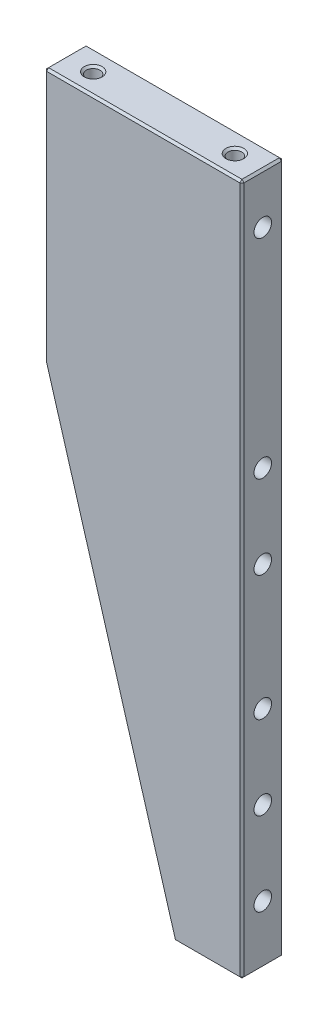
ISO-10303-21;
HEADER;
FILE_DESCRIPTION(('STEP AP214'),'2;1');
FILE_NAME('part.step','',(''),(''),'','','');
FILE_SCHEMA(('AUTOMOTIVE_DESIGN { 1 0 10303 214 1 1 1 1 }'));
ENDSEC;
DATA;
#1=APPLICATION_CONTEXT('core data for automotive mechanical design processes');
#2=APPLICATION_PROTOCOL_DEFINITION('international standard','automotive_design',2000,#1);
#3=PRODUCT_CONTEXT('',#1,'mechanical');
#4=PRODUCT('Part','Part','',(#3));
#5=PRODUCT_RELATED_PRODUCT_CATEGORY('part','',(#4));
#6=PRODUCT_DEFINITION_FORMATION('','',#4);
#7=PRODUCT_DEFINITION_CONTEXT('part definition',#1,'design');
#8=PRODUCT_DEFINITION('design','',#6,#7);
#9=PRODUCT_DEFINITION_SHAPE('','',#8);
#10=(LENGTH_UNIT() NAMED_UNIT(*) SI_UNIT(.MILLI.,.METRE.));
#11=(NAMED_UNIT(*) PLANE_ANGLE_UNIT() SI_UNIT($,.RADIAN.));
#12=(NAMED_UNIT(*) SI_UNIT($,.STERADIAN.) SOLID_ANGLE_UNIT());
#13=UNCERTAINTY_MEASURE_WITH_UNIT(LENGTH_MEASURE(1.E-05),#10,'distance_accuracy_value','');
#14=(GEOMETRIC_REPRESENTATION_CONTEXT(3) GLOBAL_UNCERTAINTY_ASSIGNED_CONTEXT((#13)) GLOBAL_UNIT_ASSIGNED_CONTEXT((#10,
#11,#12)) REPRESENTATION_CONTEXT('',''));
#15=CARTESIAN_POINT('',(0.,0.,0.));
#16=DIRECTION('',(0.,0.,1.));
#17=DIRECTION('',(1.,0.,0.));
#18=AXIS2_PLACEMENT_3D('',#15,#16,#17);
#19=CARTESIAN_POINT('',(45.4104599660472,-188.835616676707,10.));
#20=DIRECTION('',(0.958954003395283,0.283561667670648,0.));
#21=DIRECTION('',(-0.283561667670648,0.958954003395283,0.));
#22=AXIS2_PLACEMENT_3D('',#19,#20,#21);
#23=PLANE('',#22);
#24=DIRECTION('',(0.,0.,1.));
#25=VECTOR('',#24,1.);
#26=CARTESIAN_POINT('',(38.4480690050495,-165.290076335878,10.));
#27=LINE('',#26,#25);
#28=CARTESIAN_POINT('',(38.4480690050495,-165.290076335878,0.5));
#29=VERTEX_POINT('',#28);
#30=CARTESIAN_POINT('',(38.4480690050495,-165.290076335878,9.5));
#31=VERTEX_POINT('',#30);
#32=EDGE_CURVE('E270',#29,#31,#27,.T.);
#33=ORIENTED_EDGE('',*,*,#32,.T.);
#34=DIRECTION('',(-0.283561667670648,0.958954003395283,0.));
#35=VECTOR('',#34,1.);
#36=CARTESIAN_POINT('',(45.4104599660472,-188.835616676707,9.5));
#37=LINE('',#36,#35);
#38=CARTESIAN_POINT('',(7.59274229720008,-60.9429714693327,9.5));
#39=VERTEX_POINT('',#38);
#40=EDGE_CURVE('E273',#31,#39,#37,.T.);
#41=ORIENTED_EDGE('',*,*,#40,.T.);
#42=DIRECTION('',(0.,0.,-1.));
#43=VECTOR('',#42,1.);
#44=CARTESIAN_POINT('',(7.59274229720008,-60.9429714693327,10.));
#45=LINE('',#44,#43);
#46=CARTESIAN_POINT('',(7.59274229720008,-60.9429714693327,0.5));
#47=VERTEX_POINT('',#46);
#48=EDGE_CURVE('E202',#39,#47,#45,.T.);
#49=ORIENTED_EDGE('',*,*,#48,.T.);
#50=DIRECTION('',(0.283561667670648,-0.958954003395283,0.));
#51=VECTOR('',#50,1.);
#52=CARTESIAN_POINT('',(38.6579926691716,-166.,0.5));
#53=LINE('',#52,#51);
#54=EDGE_CURVE('E268',#47,#29,#53,.T.);
#55=ORIENTED_EDGE('',*,*,#54,.T.);
#56=EDGE_LOOP('',(#33,#41,#49,#55));
#57=FACE_BOUND('',#56,.T.);
#58=ADVANCED_FACE('F16',(#57),#23,.F.);
#59=CARTESIAN_POINT('',(55.,0.,10.));
#60=DIRECTION('',(-1.,0.,0.));
#61=DIRECTION('',(0.,-1.,0.));
#62=AXIS2_PLACEMENT_3D('',#59,#60,#61);
#63=PLANE('',#62);
#64=DIRECTION('',(0.,0.,1.));
#65=VECTOR('',#64,1.);
#66=CARTESIAN_POINT('',(55.,-0.5,10.));
#67=LINE('',#66,#65);
#68=CARTESIAN_POINT('',(55.,-0.5,0.5));
#69=VERTEX_POINT('',#68);
#70=CARTESIAN_POINT('',(55.,-0.5,9.5));
#71=VERTEX_POINT('',#70);
#72=EDGE_CURVE('E299',#69,#71,#67,.T.);
#73=ORIENTED_EDGE('',*,*,#72,.T.);
#74=DIRECTION('',(0.,-1.,0.));
#75=VECTOR('',#74,1.);
#76=CARTESIAN_POINT('',(55.,0.,9.5));
#77=LINE('',#76,#75);
#78=CARTESIAN_POINT('',(55.,-165.5,9.5));
#79=VERTEX_POINT('',#78);
#80=EDGE_CURVE('E301',#71,#79,#77,.T.);
#81=ORIENTED_EDGE('',*,*,#80,.T.);
#82=DIRECTION('',(0.,0.,-1.));
#83=VECTOR('',#82,1.);
#84=CARTESIAN_POINT('',(55.,-165.5,10.));
#85=LINE('',#84,#83);
#86=CARTESIAN_POINT('',(55.,-165.5,0.5));
#87=VERTEX_POINT('',#86);
#88=EDGE_CURVE('E297',#79,#87,#85,.T.);
#89=ORIENTED_EDGE('',*,*,#88,.T.);
#90=DIRECTION('',(0.,1.,0.));
#91=VECTOR('',#90,1.);
#92=CARTESIAN_POINT('',(55.,0.,0.5));
#93=LINE('',#92,#91);
#94=EDGE_CURVE('E295',#87,#69,#93,.T.);
#95=ORIENTED_EDGE('',*,*,#94,.T.);
#96=EDGE_LOOP('',(#73,#81,#89,#95));
#97=FACE_BOUND('',#96,.T.);
#98=CARTESIAN_POINT('',(55.,-112.,5.));
#99=DIRECTION('',(1.,0.,0.));
#100=DIRECTION('',(0.,0.,-1.));
#101=AXIS2_PLACEMENT_3D('',#98,#99,#100);
#102=CIRCLE('',#101,2.1);
#103=CARTESIAN_POINT('',(55.,-112.,2.9));
#104=VERTEX_POINT('',#103);
#105=EDGE_CURVE('E166',#104,#104,#102,.T.);
#106=ORIENTED_EDGE('',*,*,#105,.F.);
#107=EDGE_LOOP('',(#106));
#108=FACE_BOUND('',#107,.T.);
#109=CARTESIAN_POINT('',(55.,-62.,5.));
#110=DIRECTION('',(1.,0.,0.));
#111=DIRECTION('',(0.,0.,-1.));
#112=AXIS2_PLACEMENT_3D('',#109,#110,#111);
#113=CIRCLE('',#112,2.1);
#114=CARTESIAN_POINT('',(55.,-62.,2.9));
#115=VERTEX_POINT('',#114);
#116=EDGE_CURVE('E172',#115,#115,#113,.T.);
#117=ORIENTED_EDGE('',*,*,#116,.F.);
#118=EDGE_LOOP('',(#117));
#119=FACE_BOUND('',#118,.T.);
#120=CARTESIAN_POINT('',(55.,-132.,5.0000000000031));
#121=DIRECTION('',(1.,0.,0.));
#122=DIRECTION('',(0.,0.,-1.));
#123=AXIS2_PLACEMENT_3D('',#120,#121,#122);
#124=CIRCLE('',#123,2.1);
#125=CARTESIAN_POINT('',(55.,-132.,2.9000000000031));
#126=VERTEX_POINT('',#125);
#127=EDGE_CURVE('E178',#126,#126,#124,.T.);
#128=ORIENTED_EDGE('',*,*,#127,.F.);
#129=EDGE_LOOP('',(#128));
#130=FACE_BOUND('',#129,.T.);
#131=CARTESIAN_POINT('',(55.,-12.,5.));
#132=DIRECTION('',(1.,0.,0.));
#133=DIRECTION('',(0.,0.,-1.));
#134=AXIS2_PLACEMENT_3D('',#131,#132,#133);
#135=CIRCLE('',#134,2.1);
#136=CARTESIAN_POINT('',(55.,-12.,2.9));
#137=VERTEX_POINT('',#136);
#138=EDGE_CURVE('E184',#137,#137,#135,.T.);
#139=ORIENTED_EDGE('',*,*,#138,.F.);
#140=EDGE_LOOP('',(#139));
#141=FACE_BOUND('',#140,.T.);
#142=CARTESIAN_POINT('',(55.,-82.,5.0000000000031));
#143=DIRECTION('',(1.,0.,0.));
#144=DIRECTION('',(0.,0.,-1.));
#145=AXIS2_PLACEMENT_3D('',#142,#143,#144);
#146=CIRCLE('',#145,2.1);
#147=CARTESIAN_POINT('',(55.,-82.,2.9000000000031));
#148=VERTEX_POINT('',#147);
#149=EDGE_CURVE('E190',#148,#148,#146,.T.);
#150=ORIENTED_EDGE('',*,*,#149,.F.);
#151=EDGE_LOOP('',(#150));
#152=FACE_BOUND('',#151,.T.);
#153=CARTESIAN_POINT('',(55.,-152.,5.00000000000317));
#154=DIRECTION('',(1.,0.,0.));
#155=DIRECTION('',(0.,0.,-1.));
#156=AXIS2_PLACEMENT_3D('',#153,#154,#155);
#157=CIRCLE('',#156,2.1);
#158=CARTESIAN_POINT('',(55.,-152.,2.90000000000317));
#159=VERTEX_POINT('',#158);
#160=EDGE_CURVE('E196',#159,#159,#157,.T.);
#161=ORIENTED_EDGE('',*,*,#160,.F.);
#162=EDGE_LOOP('',(#161));
#163=FACE_BOUND('',#162,.T.);
#164=ADVANCED_FACE('F444',(#97,#108,#119,#130,#141,#152,#163),#63,.F.);
#165=CARTESIAN_POINT('',(0.,0.,10.));
#166=DIRECTION('',(0.,-1.,0.));
#167=DIRECTION('',(0.,0.,-1.));
#168=AXIS2_PLACEMENT_3D('',#165,#166,#167);
#169=PLANE('',#168);
#170=CARTESIAN_POINT('',(48.2963711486,0.,5.));
#171=DIRECTION('',(0.,-1.,0.));
#172=DIRECTION('',(0.,0.,-1.));
#173=AXIS2_PLACEMENT_3D('',#170,#171,#172);
#174=CIRCLE('',#173,2.14999999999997);
#175=CARTESIAN_POINT('',(48.2963711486,0.,2.85000000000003));
#176=VERTEX_POINT('',#175);
#177=EDGE_CURVE('E262',#176,#176,#174,.T.);
#178=ORIENTED_EDGE('',*,*,#177,.T.);
#179=EDGE_LOOP('',(#178));
#180=FACE_BOUND('',#179,.T.);
#181=CARTESIAN_POINT('',(14.2963711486,0.,5.));
#182=DIRECTION('',(0.,-1.,0.));
#183=DIRECTION('',(0.,0.,-1.));
#184=AXIS2_PLACEMENT_3D('',#181,#182,#183);
#185=CIRCLE('',#184,2.15);
#186=CARTESIAN_POINT('',(14.2963711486,0.,2.85));
#187=VERTEX_POINT('',#186);
#188=EDGE_CURVE('E259',#187,#187,#185,.T.);
#189=ORIENTED_EDGE('',*,*,#188,.T.);
#190=EDGE_LOOP('',(#189));
#191=FACE_BOUND('',#190,.T.);
#192=DIRECTION('',(1.,0.,0.));
#193=VECTOR('',#192,1.);
#194=CARTESIAN_POINT('',(0.,0.,9.5));
#195=LINE('',#194,#193);
#196=CARTESIAN_POINT('',(8.09274229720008,0.,9.5));
#197=VERTEX_POINT('',#196);
#198=CARTESIAN_POINT('',(54.5,0.,9.5));
#199=VERTEX_POINT('',#198);
#200=EDGE_CURVE('E254',#197,#199,#195,.T.);
#201=ORIENTED_EDGE('',*,*,#200,.T.);
#202=DIRECTION('',(0.,0.,-1.));
#203=VECTOR('',#202,1.);
#204=CARTESIAN_POINT('',(54.5,0.,10.));
#205=LINE('',#204,#203);
#206=CARTESIAN_POINT('',(54.5,0.,0.5));
#207=VERTEX_POINT('',#206);
#208=EDGE_CURVE('E256',#199,#207,#205,.T.);
#209=ORIENTED_EDGE('',*,*,#208,.T.);
#210=DIRECTION('',(-1.,0.,0.));
#211=VECTOR('',#210,1.);
#212=CARTESIAN_POINT('',(7.59274229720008,0.,0.5));
#213=LINE('',#212,#211);
#214=CARTESIAN_POINT('',(8.09274229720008,0.,0.5));
#215=VERTEX_POINT('',#214);
#216=EDGE_CURVE('E250',#207,#215,#213,.T.);
#217=ORIENTED_EDGE('',*,*,#216,.T.);
#218=DIRECTION('',(0.,0.,1.));
#219=VECTOR('',#218,1.);
#220=CARTESIAN_POINT('',(8.09274229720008,0.,10.));
#221=LINE('',#220,#219);
#222=EDGE_CURVE('E252',#215,#197,#221,.T.);
#223=ORIENTED_EDGE('',*,*,#222,.T.);
#224=EDGE_LOOP('',(#201,#209,#217,#223));
#225=FACE_BOUND('',#224,.T.);
#226=ADVANCED_FACE('F428',(#180,#191,#225),#169,.F.);
#227=CARTESIAN_POINT('',(0.,0.,10.));
#228=DIRECTION('',(0.,0.,-1.));
#229=DIRECTION('',(-1.,0.,0.));
#230=AXIS2_PLACEMENT_3D('',#227,#228,#229);
#231=PLANE('',#230);
#232=DIRECTION('',(-1.,0.,0.));
#233=VECTOR('',#232,1.);
#234=CARTESIAN_POINT('',(0.,-0.5,10.));
#235=LINE('',#234,#233);
#236=CARTESIAN_POINT('',(54.5,-0.5,10.));
#237=VERTEX_POINT('',#236);
#238=CARTESIAN_POINT('',(8.09274229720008,-0.5,10.));
#239=VERTEX_POINT('',#238);
#240=EDGE_CURVE('E291',#237,#239,#235,.T.);
#241=ORIENTED_EDGE('',*,*,#240,.T.);
#242=DIRECTION('',(0.,-1.,0.));
#243=VECTOR('',#242,1.);
#244=CARTESIAN_POINT('',(8.09274229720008,0.,10.));
#245=LINE('',#244,#243);
#246=CARTESIAN_POINT('',(8.09274229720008,-60.8705956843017,10.));
#247=VERTEX_POINT('',#246);
#248=EDGE_CURVE('E293',#239,#247,#245,.T.);
#249=ORIENTED_EDGE('',*,*,#248,.T.);
#250=DIRECTION('',(0.283561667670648,-0.958954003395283,0.));
#251=VECTOR('',#250,1.);
#252=CARTESIAN_POINT('',(-9.1100630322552,-2.69383584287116,10.));
#253=LINE('',#252,#251);
#254=CARTESIAN_POINT('',(39.0315446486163,-165.5,10.));
#255=VERTEX_POINT('',#254);
#256=EDGE_CURVE('E286',#247,#255,#253,.T.);
#257=ORIENTED_EDGE('',*,*,#256,.T.);
#258=DIRECTION('',(1.,0.,0.));
#259=VECTOR('',#258,1.);
#260=CARTESIAN_POINT('',(0.,-165.5,10.));
#261=LINE('',#260,#259);
#262=CARTESIAN_POINT('',(54.5,-165.5,10.));
#263=VERTEX_POINT('',#262);
#264=EDGE_CURVE('E284',#255,#263,#261,.T.);
#265=ORIENTED_EDGE('',*,*,#264,.T.);
#266=DIRECTION('',(0.,1.,0.));
#267=VECTOR('',#266,1.);
#268=CARTESIAN_POINT('',(54.5,0.,10.));
#269=LINE('',#268,#267);
#270=EDGE_CURVE('E288',#263,#237,#269,.T.);
#271=ORIENTED_EDGE('',*,*,#270,.T.);
#272=EDGE_LOOP('',(#241,#249,#257,#265,#271));
#273=FACE_BOUND('',#272,.T.);
#274=ADVANCED_FACE('F907',(#273),#231,.F.);
#275=CARTESIAN_POINT('',(0.,0.,0.));
#276=DIRECTION('',(0.,0.,-1.));
#277=DIRECTION('',(-1.,0.,0.));
#278=AXIS2_PLACEMENT_3D('',#275,#276,#277);
#279=PLANE('',#278);
#280=DIRECTION('',(-1.,0.,0.));
#281=VECTOR('',#280,1.);
#282=CARTESIAN_POINT('',(38.6579926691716,-165.5,0.));
#283=LINE('',#282,#281);
#284=CARTESIAN_POINT('',(54.5,-165.5,0.));
#285=VERTEX_POINT('',#284);
#286=CARTESIAN_POINT('',(39.0315446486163,-165.5,0.));
#287=VERTEX_POINT('',#286);
#288=EDGE_CURVE('E25',#285,#287,#283,.T.);
#289=ORIENTED_EDGE('',*,*,#288,.T.);
#290=DIRECTION('',(-0.283561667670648,0.958954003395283,0.));
#291=VECTOR('',#290,1.);
#292=CARTESIAN_POINT('',(8.07221929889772,-60.8011906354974,0.));
#293=LINE('',#292,#291);
#294=CARTESIAN_POINT('',(8.09274229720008,-60.8705956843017,0.));
#295=VERTEX_POINT('',#294);
#296=EDGE_CURVE('E11',#287,#295,#293,.T.);
#297=ORIENTED_EDGE('',*,*,#296,.T.);
#298=DIRECTION('',(0.,1.,0.));
#299=VECTOR('',#298,1.);
#300=CARTESIAN_POINT('',(8.09274229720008,0.,0.));
#301=LINE('',#300,#299);
#302=CARTESIAN_POINT('',(8.09274229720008,-0.5,0.));
#303=VERTEX_POINT('',#302);
#304=EDGE_CURVE('E310',#295,#303,#301,.T.);
#305=ORIENTED_EDGE('',*,*,#304,.T.);
#306=DIRECTION('',(1.,0.,0.));
#307=VECTOR('',#306,1.);
#308=CARTESIAN_POINT('',(55.,-0.5,0.));
#309=LINE('',#308,#307);
#310=CARTESIAN_POINT('',(54.5,-0.5,0.));
#311=VERTEX_POINT('',#310);
#312=EDGE_CURVE('E312',#303,#311,#309,.T.);
#313=ORIENTED_EDGE('',*,*,#312,.T.);
#314=DIRECTION('',(0.,-1.,0.));
#315=VECTOR('',#314,1.);
#316=CARTESIAN_POINT('',(54.5,-166.,0.));
#317=LINE('',#316,#315);
#318=EDGE_CURVE('E36',#311,#285,#317,.T.);
#319=ORIENTED_EDGE('',*,*,#318,.T.);
#320=EDGE_LOOP('',(#289,#297,#305,#313,#319));
#321=FACE_BOUND('',#320,.T.);
#322=ADVANCED_FACE('F413',(#321),#279,.T.);
#323=CARTESIAN_POINT('',(108.469714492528,-166.,0.));
#324=DIRECTION('',(0.,1.,0.));
#325=DIRECTION('',(0.,0.,1.));
#326=AXIS2_PLACEMENT_3D('',#323,#324,#325);
#327=PLANE('',#326);
#328=DIRECTION('',(-1.,0.,0.));
#329=VECTOR('',#328,1.);
#330=CARTESIAN_POINT('',(108.469714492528,-166.,9.5));
#331=LINE('',#330,#329);
#332=CARTESIAN_POINT('',(54.5,-166.,9.5));
#333=VERTEX_POINT('',#332);
#334=CARTESIAN_POINT('',(39.1579926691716,-166.,9.5));
#335=VERTEX_POINT('',#334);
#336=EDGE_CURVE('E279',#333,#335,#331,.T.);
#337=ORIENTED_EDGE('',*,*,#336,.T.);
#338=DIRECTION('',(0.,0.,-1.));
#339=VECTOR('',#338,1.);
#340=CARTESIAN_POINT('',(39.1579926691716,-166.,0.));
#341=LINE('',#340,#339);
#342=CARTESIAN_POINT('',(39.1579926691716,-166.,0.5));
#343=VERTEX_POINT('',#342);
#344=EDGE_CURVE('E281',#335,#343,#341,.T.);
#345=ORIENTED_EDGE('',*,*,#344,.T.);
#346=DIRECTION('',(1.,0.,0.));
#347=VECTOR('',#346,1.);
#348=CARTESIAN_POINT('',(55.,-166.,0.5));
#349=LINE('',#348,#347);
#350=CARTESIAN_POINT('',(54.5,-166.,0.5));
#351=VERTEX_POINT('',#350);
#352=EDGE_CURVE('E275',#343,#351,#349,.T.);
#353=ORIENTED_EDGE('',*,*,#352,.T.);
#354=DIRECTION('',(0.,0.,1.));
#355=VECTOR('',#354,1.);
#356=CARTESIAN_POINT('',(54.5,-166.,0.));
#357=LINE('',#356,#355);
#358=EDGE_CURVE('E277',#351,#333,#357,.T.);
#359=ORIENTED_EDGE('',*,*,#358,.T.);
#360=EDGE_LOOP('',(#337,#345,#353,#359));
#361=FACE_BOUND('',#360,.T.);
#362=ADVANCED_FACE('F453',(#361),#327,.F.);
#363=CARTESIAN_POINT('',(7.59274229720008,0.,0.));
#364=DIRECTION('',(1.,0.,0.));
#365=DIRECTION('',(0.,0.,-1.));
#366=AXIS2_PLACEMENT_3D('',#363,#364,#365);
#367=PLANE('',#366);
#368=ORIENTED_EDGE('',*,*,#48,.F.);
#369=DIRECTION('',(0.,1.,0.));
#370=VECTOR('',#369,1.);
#371=CARTESIAN_POINT('',(7.59274229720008,0.,9.5));
#372=LINE('',#371,#370);
#373=CARTESIAN_POINT('',(7.59274229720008,-0.5,9.5));
#374=VERTEX_POINT('',#373);
#375=EDGE_CURVE('E308',#39,#374,#372,.T.);
#376=ORIENTED_EDGE('',*,*,#375,.T.);
#377=DIRECTION('',(0.,0.,-1.));
#378=VECTOR('',#377,1.);
#379=CARTESIAN_POINT('',(7.59274229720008,-0.5,0.));
#380=LINE('',#379,#378);
#381=CARTESIAN_POINT('',(7.59274229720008,-0.5,0.5));
#382=VERTEX_POINT('',#381);
#383=EDGE_CURVE('E306',#374,#382,#380,.T.);
#384=ORIENTED_EDGE('',*,*,#383,.T.);
#385=DIRECTION('',(0.,-1.,0.));
#386=VECTOR('',#385,1.);
#387=CARTESIAN_POINT('',(7.59274229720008,-60.9429714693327,0.5));
#388=LINE('',#387,#386);
#389=EDGE_CURVE('E304',#382,#47,#388,.T.);
#390=ORIENTED_EDGE('',*,*,#389,.T.);
#391=EDGE_LOOP('',(#368,#376,#384,#390));
#392=FACE_BOUND('',#391,.T.);
#393=ADVANCED_FACE('F472',(#392),#367,.F.);
#394=CARTESIAN_POINT('',(42.6,-152.,5.00000000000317));
#395=DIRECTION('',(1.,0.,0.));
#396=DIRECTION('',(0.,0.,-1.));
#397=AXIS2_PLACEMENT_3D('',#394,#395,#396);
#398=CONICAL_SURFACE('',#397,2.1,1.02974425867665);
#399=CARTESIAN_POINT('',(41.3381927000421,-152.,5.00000000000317));
#400=VERTEX_POINT('',#399);
#401=VERTEX_LOOP('',#400);
#402=FACE_BOUND('',#401,.T.);
#403=CARTESIAN_POINT('',(42.6,-152.,5.00000000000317));
#404=DIRECTION('',(1.,0.,0.));
#405=DIRECTION('',(0.,0.,-1.));
#406=AXIS2_PLACEMENT_3D('',#403,#404,#405);
#407=CIRCLE('',#406,2.1);
#408=CARTESIAN_POINT('',(42.6,-152.,2.90000000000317));
#409=VERTEX_POINT('',#408);
#410=EDGE_CURVE('E199',#409,#409,#407,.T.);
#411=ORIENTED_EDGE('',*,*,#410,.T.);
#412=EDGE_LOOP('',(#411));
#413=FACE_BOUND('',#412,.T.);
#414=ADVANCED_FACE('F872',(#402,#413),#398,.F.);
#415=CARTESIAN_POINT('',(55.,-152.,5.00000000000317));
#416=DIRECTION('',(1.,0.,0.));
#417=DIRECTION('',(0.,0.,-1.));
#418=AXIS2_PLACEMENT_3D('',#415,#416,#417);
#419=CYLINDRICAL_SURFACE('',#418,2.1);
#420=ORIENTED_EDGE('',*,*,#410,.F.);
#421=EDGE_LOOP('',(#420));
#422=FACE_BOUND('',#421,.T.);
#423=ORIENTED_EDGE('',*,*,#160,.T.);
#424=EDGE_LOOP('',(#423));
#425=FACE_BOUND('',#424,.T.);
#426=ADVANCED_FACE('F862',(#422,#425),#419,.F.);
#427=CARTESIAN_POINT('',(42.6,-82.,5.0000000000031));
#428=DIRECTION('',(1.,0.,0.));
#429=DIRECTION('',(0.,0.,-1.));
#430=AXIS2_PLACEMENT_3D('',#427,#428,#429);
#431=CONICAL_SURFACE('',#430,2.1,1.02974425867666);
#432=CARTESIAN_POINT('',(41.3381927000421,-82.,5.0000000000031));
#433=VERTEX_POINT('',#432);
#434=VERTEX_LOOP('',#433);
#435=FACE_BOUND('',#434,.T.);
#436=CARTESIAN_POINT('',(42.6,-82.,5.0000000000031));
#437=DIRECTION('',(1.,0.,0.));
#438=DIRECTION('',(0.,0.,-1.));
#439=AXIS2_PLACEMENT_3D('',#436,#437,#438);
#440=CIRCLE('',#439,2.1);
#441=CARTESIAN_POINT('',(42.6,-82.,2.9000000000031));
#442=VERTEX_POINT('',#441);
#443=EDGE_CURVE('E193',#442,#442,#440,.T.);
#444=ORIENTED_EDGE('',*,*,#443,.T.);
#445=EDGE_LOOP('',(#444));
#446=FACE_BOUND('',#445,.T.);
#447=ADVANCED_FACE('F852',(#435,#446),#431,.F.);
#448=CARTESIAN_POINT('',(55.,-82.,5.0000000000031));
#449=DIRECTION('',(1.,0.,0.));
#450=DIRECTION('',(0.,0.,-1.));
#451=AXIS2_PLACEMENT_3D('',#448,#449,#450);
#452=CYLINDRICAL_SURFACE('',#451,2.1);
#453=ORIENTED_EDGE('',*,*,#443,.F.);
#454=EDGE_LOOP('',(#453));
#455=FACE_BOUND('',#454,.T.);
#456=ORIENTED_EDGE('',*,*,#149,.T.);
#457=EDGE_LOOP('',(#456));
#458=FACE_BOUND('',#457,.T.);
#459=ADVANCED_FACE('F843',(#455,#458),#452,.F.);
#460=CARTESIAN_POINT('',(42.6,-12.,5.));
#461=DIRECTION('',(1.,0.,0.));
#462=DIRECTION('',(0.,0.,-1.));
#463=AXIS2_PLACEMENT_3D('',#460,#461,#462);
#464=CONICAL_SURFACE('',#463,2.1,1.02974425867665);
#465=CARTESIAN_POINT('',(41.3381927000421,-12.,5.));
#466=VERTEX_POINT('',#465);
#467=VERTEX_LOOP('',#466);
#468=FACE_BOUND('',#467,.T.);
#469=CARTESIAN_POINT('',(42.6,-12.,5.));
#470=DIRECTION('',(1.,0.,0.));
#471=DIRECTION('',(0.,0.,-1.));
#472=AXIS2_PLACEMENT_3D('',#469,#470,#471);
#473=CIRCLE('',#472,2.1);
#474=CARTESIAN_POINT('',(42.6,-12.,2.9));
#475=VERTEX_POINT('',#474);
#476=EDGE_CURVE('E187',#475,#475,#473,.T.);
#477=ORIENTED_EDGE('',*,*,#476,.T.);
#478=EDGE_LOOP('',(#477));
#479=FACE_BOUND('',#478,.T.);
#480=ADVANCED_FACE('F834',(#468,#479),#464,.F.);
#481=CARTESIAN_POINT('',(55.,-12.,5.));
#482=DIRECTION('',(1.,0.,0.));
#483=DIRECTION('',(0.,0.,-1.));
#484=AXIS2_PLACEMENT_3D('',#481,#482,#483);
#485=CYLINDRICAL_SURFACE('',#484,2.1);
#486=CARTESIAN_POINT('',(49.9942527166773,-10.0006579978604,4.35763596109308));
#487=CARTESIAN_POINT('',(49.9664411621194,-10.0100636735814,4.3283811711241));
#488=CARTESIAN_POINT('',(49.9374204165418,-10.0197465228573,4.30042669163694));
#489=CARTESIAN_POINT('',(49.8773721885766,-10.0394427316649,4.24698573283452));
#490=CARTESIAN_POINT('',(49.84634787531,-10.0494555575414,4.22149550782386));
#491=CARTESIAN_POINT('',(49.7509422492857,-10.0796387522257,4.14854093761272));
#492=CARTESIAN_POINT('',(49.6840563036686,-10.1000130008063,4.10441865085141));
#493=CARTESIAN_POINT('',(49.5577660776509,-10.1364419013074,4.03123340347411));
#494=CARTESIAN_POINT('',(49.4991230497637,-10.1526245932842,4.00088692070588));
#495=CARTESIAN_POINT('',(49.3792074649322,-10.1838513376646,3.94519209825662));
#496=CARTESIAN_POINT('',(49.3179336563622,-10.1988948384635,3.91984617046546));
#497=CARTESIAN_POINT('',(49.1304488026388,-10.2415005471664,3.8508075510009));
#498=CARTESIAN_POINT('',(49.000860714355,-10.2664507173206,3.81427459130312));
#499=CARTESIAN_POINT('',(48.8018152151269,-10.2953259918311,3.77348050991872));
#500=CARTESIAN_POINT('',(48.7342964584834,-10.3035477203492,3.76219353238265));
#501=CARTESIAN_POINT('',(48.5982708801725,-10.3165997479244,3.74449604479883));
#502=CARTESIAN_POINT('',(48.5297640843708,-10.3214301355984,3.73808540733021));
#503=CARTESIAN_POINT('',(48.3924918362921,-10.3273787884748,3.73021192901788));
#504=CARTESIAN_POINT('',(48.3237275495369,-10.3285068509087,3.72873602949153));
#505=CARTESIAN_POINT('',(48.1863132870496,-10.3270064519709,3.73071112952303));
#506=CARTESIAN_POINT('',(48.1176633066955,-10.3243781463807,3.73416192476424));
#507=CARTESIAN_POINT('',(47.9842338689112,-10.3157431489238,3.74567632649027));
#508=CARTESIAN_POINT('',(47.9194242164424,-10.309901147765,3.75351537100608));
#509=CARTESIAN_POINT('',(47.7908147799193,-10.295286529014,3.77358162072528));
#510=CARTESIAN_POINT('',(47.7270154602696,-10.2865126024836,3.78581078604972));
#511=CARTESIAN_POINT('',(47.5373649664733,-10.256373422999,3.82908938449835));
#512=CARTESIAN_POINT('',(47.4135195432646,-10.2312103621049,3.86670759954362));
#513=CARTESIAN_POINT('',(47.1916796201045,-10.1789925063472,3.95305814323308));
#514=CARTESIAN_POINT('',(47.0925391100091,-10.1527397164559,3.99939123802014));
#515=CARTESIAN_POINT('',(46.9031436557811,-10.0986609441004,4.10640633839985));
#516=CARTESIAN_POINT('',(46.8128430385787,-10.0708443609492,4.16700840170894));
#517=CARTESIAN_POINT('',(46.7063952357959,-10.0365049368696,4.25495457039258));
#518=CARTESIAN_POINT('',(46.6839879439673,-10.0291775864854,4.27452128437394));
#519=CARTESIAN_POINT('',(46.6403249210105,-10.0147340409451,4.31503027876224));
#520=CARTESIAN_POINT('',(46.6190707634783,-10.0076181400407,4.33597435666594));
#521=CARTESIAN_POINT('',(46.5984895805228,-10.0006579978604,4.35763596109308));
#522=B_SPLINE_CURVE_WITH_KNOTS('',3,(#486,#487,#488,#489,#490,#491,#492,#493,#494,#495,#496,
#497,#498,#499,#500,#501,#502,#503,#504,#505,#506,#507,#508,#509,#510,#511,#512,#513,#514,#515,
#516,#517,#518,#519,#520,#521),.UNSPECIFIED.,.F.,.F.,(4,2,2,2,2,2,2,2,2,2,2,2,2,2,2,2,2,4),(0.,
0.12423167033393,0.248271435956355,0.495602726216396,0.699308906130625,0.903113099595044,
1.31172930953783,1.51837453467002,1.72501435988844,1.93110692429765,2.13719094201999,
2.33358329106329,2.53006343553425,2.92379500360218,3.26049335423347,3.59534843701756,
3.68721638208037,3.77920669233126),.UNSPECIFIED.);
#523=CARTESIAN_POINT('',(49.6829136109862,-10.1,4.10557280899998));
#524=VERTEX_POINT('',#523);
#525=CARTESIAN_POINT('',(46.9098286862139,-10.1,4.10557280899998));
#526=VERTEX_POINT('',#525);
#527=EDGE_CURVE('E214',#524,#526,#522,.T.);
#528=ORIENTED_EDGE('',*,*,#527,.T.);
#529=CARTESIAN_POINT('',(46.9098286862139,-10.1,4.10557280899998));
#530=CARTESIAN_POINT('',(46.8891708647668,-10.0849229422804,4.13760160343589));
#531=CARTESIAN_POINT('',(46.8695020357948,-10.070413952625,4.17052543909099));
#532=CARTESIAN_POINT('',(46.8322856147,-10.0427340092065,4.23812882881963));
#533=CARTESIAN_POINT('',(46.8147398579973,-10.0295642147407,4.27280986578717));
#534=CARTESIAN_POINT('',(46.7654119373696,-9.99229783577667,4.37965849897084));
#535=CARTESIAN_POINT('',(46.7371202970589,-9.97057816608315,4.45435412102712));
#536=CARTESIAN_POINT('',(46.6912618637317,-9.93513617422,4.60925649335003));
#537=CARTESIAN_POINT('',(46.6737522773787,-9.92145652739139,4.68949017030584));
#538=CARTESIAN_POINT('',(46.6509273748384,-9.9035903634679,4.85250687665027));
#539=CARTESIAN_POINT('',(46.6455741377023,-9.89937432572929,4.93528115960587));
#540=CARTESIAN_POINT('',(46.6472816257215,-9.90071487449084,5.09305918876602));
#541=CARTESIAN_POINT('',(46.6532587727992,-9.90541845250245,5.16808572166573));
#542=CARTESIAN_POINT('',(46.6751591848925,-9.92255405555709,5.31584259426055));
#543=CARTESIAN_POINT('',(46.6910950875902,-9.93499590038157,5.38856989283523));
#544=CARTESIAN_POINT('',(46.7319338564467,-9.96657967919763,5.52953537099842));
#545=CARTESIAN_POINT('',(46.756799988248,-9.98569415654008,5.59779060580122));
#546=CARTESIAN_POINT('',(46.8143758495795,-10.0293511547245,5.72891061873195));
#547=CARTESIAN_POINT('',(46.8470750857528,-10.0538864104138,5.79178245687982));
#548=CARTESIAN_POINT('',(46.8918445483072,-10.0868451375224,5.86607763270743));
#549=CARTESIAN_POINT('',(46.9007425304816,-10.0933688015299,5.88034285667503));
#550=CARTESIAN_POINT('',(46.9098286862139,-10.1,5.89442719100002));
#551=B_SPLINE_CURVE_WITH_KNOTS('',3,(#529,#530,#531,#532,#533,#534,#535,#536,#537,#538,#539,
#540,#541,#542,#543,#544,#545,#546,#547,#548,#549,#550),.UNSPECIFIED.,.F.,.F.,(4,2,2,2,2,2,2,2,
2,2,4),(0.,0.122911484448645,0.245928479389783,0.493023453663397,0.741418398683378,
0.989037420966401,1.21416125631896,1.43957135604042,1.6640646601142,1.88825889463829,
1.94234958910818),.UNSPECIFIED.);
#552=CARTESIAN_POINT('',(46.9098286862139,-10.1,5.89442719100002));
#553=VERTEX_POINT('',#552);
#554=EDGE_CURVE('E235',#526,#553,#551,.T.);
#555=ORIENTED_EDGE('',*,*,#554,.T.);
#556=CARTESIAN_POINT('',(46.5984895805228,-10.0006579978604,5.64236403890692));
#557=CARTESIAN_POINT('',(46.6263011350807,-10.0100636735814,5.67161882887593));
#558=CARTESIAN_POINT('',(46.6553218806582,-10.0197465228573,5.6995733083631));
#559=CARTESIAN_POINT('',(46.7153701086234,-10.0394427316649,5.75301426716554));
#560=CARTESIAN_POINT('',(46.74639442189,-10.0494555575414,5.7785044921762));
#561=CARTESIAN_POINT('',(46.8418000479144,-10.0796387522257,5.85145906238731));
#562=CARTESIAN_POINT('',(46.9086859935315,-10.1000130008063,5.89558134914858));
#563=CARTESIAN_POINT('',(47.0349762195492,-10.1364419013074,5.96876659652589));
#564=CARTESIAN_POINT('',(47.0936192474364,-10.1526245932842,5.99911307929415));
#565=CARTESIAN_POINT('',(47.2135348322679,-10.1838513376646,6.05480790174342));
#566=CARTESIAN_POINT('',(47.2748086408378,-10.1988948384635,6.08015382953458));
#567=CARTESIAN_POINT('',(47.4622934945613,-10.2415005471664,6.14919244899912));
#568=CARTESIAN_POINT('',(47.5918815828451,-10.2664507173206,6.18572540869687));
#569=CARTESIAN_POINT('',(47.7909270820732,-10.2953259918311,6.22651949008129));
#570=CARTESIAN_POINT('',(47.8584458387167,-10.3035477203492,6.23780646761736));
#571=CARTESIAN_POINT('',(47.9944714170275,-10.3165997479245,6.25550395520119));
#572=CARTESIAN_POINT('',(48.0629782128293,-10.3214301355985,6.2619145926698));
#573=CARTESIAN_POINT('',(48.200250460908,-10.3273787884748,6.26978807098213));
#574=CARTESIAN_POINT('',(48.2690147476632,-10.3285068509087,6.27126397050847));
#575=CARTESIAN_POINT('',(48.4064290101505,-10.3270064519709,6.26928887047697));
#576=CARTESIAN_POINT('',(48.4750789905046,-10.3243781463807,6.26583807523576));
#577=CARTESIAN_POINT('',(48.6085084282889,-10.3157431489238,6.25432367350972));
#578=CARTESIAN_POINT('',(48.6733180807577,-10.309901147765,6.24648462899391));
#579=CARTESIAN_POINT('',(48.8019275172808,-10.295286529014,6.2264183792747));
#580=CARTESIAN_POINT('',(48.8657268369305,-10.2865126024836,6.21418921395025));
#581=CARTESIAN_POINT('',(49.0553773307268,-10.256373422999,6.17091061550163));
#582=CARTESIAN_POINT('',(49.1792227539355,-10.2312103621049,6.13329240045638));
#583=CARTESIAN_POINT('',(49.4010626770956,-10.1789925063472,6.04694185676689));
#584=CARTESIAN_POINT('',(49.5002031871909,-10.1527397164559,6.0006087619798));
#585=CARTESIAN_POINT('',(49.689598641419,-10.0986609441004,5.89359366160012));
#586=CARTESIAN_POINT('',(49.7798992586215,-10.0708443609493,5.83299159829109));
#587=CARTESIAN_POINT('',(49.8863470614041,-10.0365049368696,5.7450454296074));
#588=CARTESIAN_POINT('',(49.9087543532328,-10.0291775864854,5.72547871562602));
#589=CARTESIAN_POINT('',(49.9524173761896,-10.0147340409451,5.68496972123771));
#590=CARTESIAN_POINT('',(49.9736715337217,-10.0076181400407,5.66402564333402));
#591=CARTESIAN_POINT('',(49.9942527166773,-10.0006579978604,5.64236403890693));
#592=B_SPLINE_CURVE_WITH_KNOTS('',3,(#556,#557,#558,#559,#560,#561,#562,#563,#564,#565,#566,
#567,#568,#569,#570,#571,#572,#573,#574,#575,#576,#577,#578,#579,#580,#581,#582,#583,#584,#585,
#586,#587,#588,#589,#590,#591),.UNSPECIFIED.,.F.,.F.,(4,2,2,2,2,2,2,2,2,2,2,2,2,2,2,2,2,4),(0.,
0.124231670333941,0.248271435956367,0.495602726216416,0.699308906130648,0.903113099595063,
1.31172930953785,1.51837453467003,1.72501435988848,1.93110692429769,2.13719094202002,
2.33358329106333,2.53006343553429,2.92379500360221,3.2604933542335,3.59534843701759,
3.68721638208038,3.77920669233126),.UNSPECIFIED.);
#593=CARTESIAN_POINT('',(49.6829136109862,-10.1,5.89442719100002));
#594=VERTEX_POINT('',#593);
#595=EDGE_CURVE('E243',#553,#594,#592,.T.);
#596=ORIENTED_EDGE('',*,*,#595,.T.);
#597=CARTESIAN_POINT('',(49.6829136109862,-10.1,5.89442719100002));
#598=CARTESIAN_POINT('',(49.7035714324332,-10.0849229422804,5.86239839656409));
#599=CARTESIAN_POINT('',(49.7232402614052,-10.0704139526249,5.82947456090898));
#600=CARTESIAN_POINT('',(49.7604566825,-10.0427340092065,5.76187117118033));
#601=CARTESIAN_POINT('',(49.7780024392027,-10.0295642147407,5.72719013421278));
#602=CARTESIAN_POINT('',(49.8273303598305,-9.99229783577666,5.62034150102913));
#603=CARTESIAN_POINT('',(49.8556220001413,-9.97057816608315,5.54564587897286));
#604=CARTESIAN_POINT('',(49.9014804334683,-9.93513617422,5.39074350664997));
#605=CARTESIAN_POINT('',(49.9189900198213,-9.92145652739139,5.31050982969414));
#606=CARTESIAN_POINT('',(49.9418149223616,-9.90359036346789,5.1474931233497));
#607=CARTESIAN_POINT('',(49.9471681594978,-9.89937432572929,5.06471884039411));
#608=CARTESIAN_POINT('',(49.9454606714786,-9.90071487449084,4.90694081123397));
#609=CARTESIAN_POINT('',(49.9394835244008,-9.90541845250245,4.83191427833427));
#610=CARTESIAN_POINT('',(49.9175831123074,-9.92255405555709,4.68415740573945));
#611=CARTESIAN_POINT('',(49.9016472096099,-9.93499590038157,4.61143010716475));
#612=CARTESIAN_POINT('',(49.8608084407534,-9.96657967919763,4.47046462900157));
#613=CARTESIAN_POINT('',(49.8359423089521,-9.98569415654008,4.40220939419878));
#614=CARTESIAN_POINT('',(49.7783664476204,-10.0293511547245,4.27108938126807));
#615=CARTESIAN_POINT('',(49.7456672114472,-10.0538864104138,4.2082175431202));
#616=CARTESIAN_POINT('',(49.7008977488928,-10.0868451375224,4.13392236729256));
#617=CARTESIAN_POINT('',(49.6919997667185,-10.0933688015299,4.11965714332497));
#618=CARTESIAN_POINT('',(49.6829136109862,-10.1,4.10557280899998));
#619=B_SPLINE_CURVE_WITH_KNOTS('',3,(#597,#598,#599,#600,#601,#602,#603,#604,#605,#606,#607,
#608,#609,#610,#611,#612,#613,#614,#615,#616,#617,#618),.UNSPECIFIED.,.F.,.F.,(4,2,2,2,2,2,2,2,
2,2,4),(0.,0.122911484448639,0.245928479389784,0.493023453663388,0.741418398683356,
0.989037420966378,1.21416125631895,1.43957135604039,1.66406466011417,1.88825889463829,
1.94234958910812),.UNSPECIFIED.);
#620=EDGE_CURVE('E205',#594,#524,#619,.T.);
#621=ORIENTED_EDGE('',*,*,#620,.T.);
#622=EDGE_LOOP('',(#528,#555,#596,#621));
#623=FACE_BOUND('',#622,.T.);
#624=ORIENTED_EDGE('',*,*,#476,.F.);
#625=EDGE_LOOP('',(#624));
#626=FACE_BOUND('',#625,.T.);
#627=ORIENTED_EDGE('',*,*,#138,.T.);
#628=EDGE_LOOP('',(#627));
#629=FACE_BOUND('',#628,.T.);
#630=ADVANCED_FACE('F221',(#623,#626,#629),#485,.F.);
#631=CARTESIAN_POINT('',(42.6,-132.,5.0000000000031));
#632=DIRECTION('',(1.,0.,0.));
#633=DIRECTION('',(0.,0.,-1.));
#634=AXIS2_PLACEMENT_3D('',#631,#632,#633);
#635=CONICAL_SURFACE('',#634,2.1,1.02974425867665);
#636=CARTESIAN_POINT('',(41.3381927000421,-132.,5.0000000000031));
#637=VERTEX_POINT('',#636);
#638=VERTEX_LOOP('',#637);
#639=FACE_BOUND('',#638,.T.);
#640=CARTESIAN_POINT('',(42.6,-132.,5.0000000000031));
#641=DIRECTION('',(1.,0.,0.));
#642=DIRECTION('',(0.,0.,-1.));
#643=AXIS2_PLACEMENT_3D('',#640,#641,#642);
#644=CIRCLE('',#643,2.1);
#645=CARTESIAN_POINT('',(42.6,-132.,2.9000000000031));
#646=VERTEX_POINT('',#645);
#647=EDGE_CURVE('E181',#646,#646,#644,.T.);
#648=ORIENTED_EDGE('',*,*,#647,.T.);
#649=EDGE_LOOP('',(#648));
#650=FACE_BOUND('',#649,.T.);
#651=ADVANCED_FACE('F816',(#639,#650),#635,.F.);
#652=CARTESIAN_POINT('',(55.,-132.,5.0000000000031));
#653=DIRECTION('',(1.,0.,0.));
#654=DIRECTION('',(0.,0.,-1.));
#655=AXIS2_PLACEMENT_3D('',#652,#653,#654);
#656=CYLINDRICAL_SURFACE('',#655,2.1);
#657=ORIENTED_EDGE('',*,*,#647,.F.);
#658=EDGE_LOOP('',(#657));
#659=FACE_BOUND('',#658,.T.);
#660=ORIENTED_EDGE('',*,*,#127,.T.);
#661=EDGE_LOOP('',(#660));
#662=FACE_BOUND('',#661,.T.);
#663=ADVANCED_FACE('F806',(#659,#662),#656,.F.);
#664=CARTESIAN_POINT('',(42.6,-62.,5.));
#665=DIRECTION('',(1.,0.,0.));
#666=DIRECTION('',(0.,0.,-1.));
#667=AXIS2_PLACEMENT_3D('',#664,#665,#666);
#668=CONICAL_SURFACE('',#667,2.1,1.02974425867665);
#669=CARTESIAN_POINT('',(41.3381927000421,-62.,5.));
#670=VERTEX_POINT('',#669);
#671=VERTEX_LOOP('',#670);
#672=FACE_BOUND('',#671,.T.);
#673=CARTESIAN_POINT('',(42.6,-62.,5.));
#674=DIRECTION('',(1.,0.,0.));
#675=DIRECTION('',(0.,0.,-1.));
#676=AXIS2_PLACEMENT_3D('',#673,#674,#675);
#677=CIRCLE('',#676,2.1);
#678=CARTESIAN_POINT('',(42.6,-62.,2.9));
#679=VERTEX_POINT('',#678);
#680=EDGE_CURVE('E175',#679,#679,#677,.T.);
#681=ORIENTED_EDGE('',*,*,#680,.T.);
#682=EDGE_LOOP('',(#681));
#683=FACE_BOUND('',#682,.T.);
#684=ADVANCED_FACE('F796',(#672,#683),#668,.F.);
#685=CARTESIAN_POINT('',(55.,-62.,5.));
#686=DIRECTION('',(1.,0.,0.));
#687=DIRECTION('',(0.,0.,-1.));
#688=AXIS2_PLACEMENT_3D('',#685,#686,#687);
#689=CYLINDRICAL_SURFACE('',#688,2.1);
#690=ORIENTED_EDGE('',*,*,#680,.F.);
#691=EDGE_LOOP('',(#690));
#692=FACE_BOUND('',#691,.T.);
#693=ORIENTED_EDGE('',*,*,#116,.T.);
#694=EDGE_LOOP('',(#693));
#695=FACE_BOUND('',#694,.T.);
#696=ADVANCED_FACE('F786',(#692,#695),#689,.F.);
#697=CARTESIAN_POINT('',(42.6,-112.,5.));
#698=DIRECTION('',(1.,0.,0.));
#699=DIRECTION('',(0.,0.,-1.));
#700=AXIS2_PLACEMENT_3D('',#697,#698,#699);
#701=CONICAL_SURFACE('',#700,2.1,1.02974425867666);
#702=CARTESIAN_POINT('',(41.3381927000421,-112.,5.));
#703=VERTEX_POINT('',#702);
#704=VERTEX_LOOP('',#703);
#705=FACE_BOUND('',#704,.T.);
#706=CARTESIAN_POINT('',(42.6,-112.,5.));
#707=DIRECTION('',(1.,0.,0.));
#708=DIRECTION('',(0.,0.,-1.));
#709=AXIS2_PLACEMENT_3D('',#706,#707,#708);
#710=CIRCLE('',#709,2.1);
#711=CARTESIAN_POINT('',(42.6,-112.,2.9));
#712=VERTEX_POINT('',#711);
#713=EDGE_CURVE('E169',#712,#712,#710,.T.);
#714=ORIENTED_EDGE('',*,*,#713,.T.);
#715=EDGE_LOOP('',(#714));
#716=FACE_BOUND('',#715,.T.);
#717=ADVANCED_FACE('F777',(#705,#716),#701,.F.);
#718=CARTESIAN_POINT('',(55.,-112.,5.));
#719=DIRECTION('',(1.,0.,0.));
#720=DIRECTION('',(0.,0.,-1.));
#721=AXIS2_PLACEMENT_3D('',#718,#719,#720);
#722=CYLINDRICAL_SURFACE('',#721,2.1);
#723=ORIENTED_EDGE('',*,*,#713,.F.);
#724=EDGE_LOOP('',(#723));
#725=FACE_BOUND('',#724,.T.);
#726=ORIENTED_EDGE('',*,*,#105,.T.);
#727=EDGE_LOOP('',(#726));
#728=FACE_BOUND('',#727,.T.);
#729=ADVANCED_FACE('F768',(#725,#728),#722,.F.);
#730=CARTESIAN_POINT('',(48.2963711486,-10.1,5.));
#731=DIRECTION('',(0.,1.,0.));
#732=DIRECTION('',(0.,0.,1.));
#733=AXIS2_PLACEMENT_3D('',#730,#731,#732);
#734=CONICAL_SURFACE('',#733,1.65,1.02974425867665);
#735=CARTESIAN_POINT('',(48.2963711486,-10.1,5.));
#736=DIRECTION('',(0.,1.,0.));
#737=DIRECTION('',(0.,0.,1.));
#738=AXIS2_PLACEMENT_3D('',#735,#736,#737);
#739=CIRCLE('',#738,1.65);
#740=EDGE_CURVE('E158',#553,#594,#739,.T.);
#741=ORIENTED_EDGE('',*,*,#740,.T.);
#742=ORIENTED_EDGE('',*,*,#595,.F.);
#743=EDGE_LOOP('',(#741,#742));
#744=FACE_BOUND('',#743,.T.);
#745=ADVANCED_FACE('F230',(#744),#734,.F.);
#746=EDGE_CURVE('E161',#524,#526,#739,.T.);
#747=ORIENTED_EDGE('',*,*,#746,.T.);
#748=ORIENTED_EDGE('',*,*,#527,.F.);
#749=EDGE_LOOP('',(#747,#748));
#750=FACE_BOUND('',#749,.T.);
#751=ADVANCED_FACE('F227',(#750),#734,.F.);
#752=CARTESIAN_POINT('',(48.2963711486,0.,5.));
#753=DIRECTION('',(0.,1.,0.));
#754=DIRECTION('',(0.,0.,1.));
#755=AXIS2_PLACEMENT_3D('',#752,#753,#754);
#756=CYLINDRICAL_SURFACE('',#755,1.65);
#757=CARTESIAN_POINT('',(48.2963711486,-0.499999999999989,5.));
#758=DIRECTION('',(0.,-1.,0.));
#759=DIRECTION('',(0.,0.,-1.));
#760=AXIS2_PLACEMENT_3D('',#757,#758,#759);
#761=CIRCLE('',#760,1.65);
#762=CARTESIAN_POINT('',(48.2963711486,-0.499999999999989,3.35));
#763=VERTEX_POINT('',#762);
#764=EDGE_CURVE('E242',#763,#763,#761,.F.);
#765=ORIENTED_EDGE('',*,*,#764,.T.);
#766=EDGE_LOOP('',(#765));
#767=FACE_BOUND('',#766,.T.);
#768=ORIENTED_EDGE('',*,*,#746,.F.);
#769=ORIENTED_EDGE('',*,*,#620,.F.);
#770=ORIENTED_EDGE('',*,*,#740,.F.);
#771=ORIENTED_EDGE('',*,*,#554,.F.);
#772=EDGE_LOOP('',(#768,#769,#770,#771));
#773=FACE_BOUND('',#772,.T.);
#774=ADVANCED_FACE('F152',(#767,#773),#756,.F.);
#775=CARTESIAN_POINT('',(14.2963711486,-10.1,5.));
#776=DIRECTION('',(0.,1.,0.));
#777=DIRECTION('',(0.,0.,1.));
#778=AXIS2_PLACEMENT_3D('',#775,#776,#777);
#779=CONICAL_SURFACE('',#778,1.65,1.02974425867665);
#780=CARTESIAN_POINT('',(14.2963711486,-11.0914200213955,5.));
#781=VERTEX_POINT('',#780);
#782=VERTEX_LOOP('',#781);
#783=FACE_BOUND('',#782,.T.);
#784=CARTESIAN_POINT('',(14.2963711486,-10.1,5.));
#785=DIRECTION('',(0.,1.,0.));
#786=DIRECTION('',(0.,0.,1.));
#787=AXIS2_PLACEMENT_3D('',#784,#785,#786);
#788=CIRCLE('',#787,1.65);
#789=CARTESIAN_POINT('',(14.2963711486,-10.1,6.65));
#790=VERTEX_POINT('',#789);
#791=EDGE_CURVE('E156',#790,#790,#788,.T.);
#792=ORIENTED_EDGE('',*,*,#791,.T.);
#793=EDGE_LOOP('',(#792));
#794=FACE_BOUND('',#793,.T.);
#795=ADVANCED_FACE('F148',(#783,#794),#779,.F.);
#796=CARTESIAN_POINT('',(14.2963711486,0.,5.));
#797=DIRECTION('',(0.,1.,0.));
#798=DIRECTION('',(0.,0.,1.));
#799=AXIS2_PLACEMENT_3D('',#796,#797,#798);
#800=CYLINDRICAL_SURFACE('',#799,1.65);
#801=CARTESIAN_POINT('',(14.2963711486,-0.500000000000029,5.));
#802=DIRECTION('',(0.,-1.,0.));
#803=DIRECTION('',(0.,0.,-1.));
#804=AXIS2_PLACEMENT_3D('',#801,#802,#803);
#805=CIRCLE('',#804,1.65);
#806=CARTESIAN_POINT('',(14.2963711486,-0.500000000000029,3.35));
#807=VERTEX_POINT('',#806);
#808=EDGE_CURVE('E265',#807,#807,#805,.F.);
#809=ORIENTED_EDGE('',*,*,#808,.T.);
#810=EDGE_LOOP('',(#809));
#811=FACE_BOUND('',#810,.T.);
#812=ORIENTED_EDGE('',*,*,#791,.F.);
#813=EDGE_LOOP('',(#812));
#814=FACE_BOUND('',#813,.T.);
#815=ADVANCED_FACE('F151',(#811,#814),#800,.F.);
#816=CARTESIAN_POINT('',(48.2963711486,-0.499999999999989,5.));
#817=DIRECTION('',(0.,1.,0.));
#818=DIRECTION('',(0.,0.,1.));
#819=AXIS2_PLACEMENT_3D('',#816,#817,#818);
#820=CONICAL_SURFACE('',#819,1.65,0.785398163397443);
#821=ORIENTED_EDGE('',*,*,#177,.F.);
#822=EDGE_LOOP('',(#821));
#823=FACE_BOUND('',#822,.T.);
#824=ORIENTED_EDGE('',*,*,#764,.F.);
#825=EDGE_LOOP('',(#824));
#826=FACE_BOUND('',#825,.T.);
#827=ADVANCED_FACE('F499',(#823,#826),#820,.F.);
#828=CARTESIAN_POINT('',(14.2963711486,-0.500000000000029,5.));
#829=DIRECTION('',(0.,1.,0.));
#830=DIRECTION('',(0.,0.,1.));
#831=AXIS2_PLACEMENT_3D('',#828,#829,#830);
#832=CONICAL_SURFACE('',#831,1.65,0.785398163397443);
#833=ORIENTED_EDGE('',*,*,#188,.F.);
#834=EDGE_LOOP('',(#833));
#835=FACE_BOUND('',#834,.T.);
#836=ORIENTED_EDGE('',*,*,#808,.F.);
#837=EDGE_LOOP('',(#836));
#838=FACE_BOUND('',#837,.T.);
#839=ADVANCED_FACE('F502',(#835,#838),#832,.F.);
#840=CARTESIAN_POINT('',(54.5,0.,10.));
#841=DIRECTION('',(-0.707106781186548,-0.707106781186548,0.));
#842=DIRECTION('',(0.,0.,-1.));
#843=AXIS2_PLACEMENT_3D('',#840,#841,#842);
#844=PLANE('',#843);
#845=DIRECTION('',(-0.707106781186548,0.707106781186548,0.));
#846=VECTOR('',#845,1.);
#847=CARTESIAN_POINT('',(54.5,0.,0.5));
#848=LINE('',#847,#846);
#849=EDGE_CURVE('E20',#207,#69,#848,.F.);
#850=ORIENTED_EDGE('',*,*,#849,.F.);
#851=ORIENTED_EDGE('',*,*,#208,.F.);
#852=DIRECTION('',(0.707106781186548,-0.707106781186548,0.));
#853=VECTOR('',#852,1.);
#854=CARTESIAN_POINT('',(54.75,-0.25,9.5));
#855=LINE('',#854,#853);
#856=EDGE_CURVE('E377',#71,#199,#855,.F.);
#857=ORIENTED_EDGE('',*,*,#856,.F.);
#858=ORIENTED_EDGE('',*,*,#72,.F.);
#859=EDGE_LOOP('',(#850,#851,#857,#858));
#860=FACE_BOUND('',#859,.T.);
#861=ADVANCED_FACE('F18',(#860),#844,.F.);
#862=CARTESIAN_POINT('',(54.5,0.,0.5));
#863=DIRECTION('',(0.577350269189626,0.577350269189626,-0.577350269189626));
#864=DIRECTION('',(-0.707106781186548,0.,-0.707106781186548));
#865=AXIS2_PLACEMENT_3D('',#862,#863,#864);
#866=PLANE('',#865);
#867=DIRECTION('',(-0.707106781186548,0.,-0.707106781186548));
#868=VECTOR('',#867,1.);
#869=CARTESIAN_POINT('',(54.75,-0.5,0.25));
#870=LINE('',#869,#868);
#871=EDGE_CURVE('E374',#311,#69,#870,.F.);
#872=ORIENTED_EDGE('',*,*,#871,.F.);
#873=DIRECTION('',(0.,0.707106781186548,0.707106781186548));
#874=VECTOR('',#873,1.);
#875=CARTESIAN_POINT('',(54.5,0.,0.5));
#876=LINE('',#875,#874);
#877=EDGE_CURVE('E164',#207,#311,#876,.F.);
#878=ORIENTED_EDGE('',*,*,#877,.F.);
#879=ORIENTED_EDGE('',*,*,#849,.T.);
#880=EDGE_LOOP('',(#872,#878,#879));
#881=FACE_BOUND('',#880,.T.);
#882=ADVANCED_FACE('F391',(#881),#866,.T.);
#883=CARTESIAN_POINT('',(0.,0.,0.5));
#884=DIRECTION('',(0.,0.707106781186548,-0.707106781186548));
#885=DIRECTION('',(1.,0.,0.));
#886=AXIS2_PLACEMENT_3D('',#883,#884,#885);
#887=PLANE('',#886);
#888=ORIENTED_EDGE('',*,*,#877,.T.);
#889=ORIENTED_EDGE('',*,*,#312,.F.);
#890=DIRECTION('',(0.,-0.707106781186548,-0.707106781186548));
#891=VECTOR('',#890,1.);
#892=CARTESIAN_POINT('',(8.09274229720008,-0.25,0.25));
#893=LINE('',#892,#891);
#894=EDGE_CURVE('E371',#215,#303,#893,.T.);
#895=ORIENTED_EDGE('',*,*,#894,.F.);
#896=ORIENTED_EDGE('',*,*,#216,.F.);
#897=EDGE_LOOP('',(#888,#889,#895,#896));
#898=FACE_BOUND('',#897,.T.);
#899=ADVANCED_FACE('F387',(#898),#887,.T.);
#900=CARTESIAN_POINT('',(8.09274229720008,0.,10.));
#901=DIRECTION('',(0.707106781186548,-0.707106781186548,0.));
#902=DIRECTION('',(0.,0.,1.));
#903=AXIS2_PLACEMENT_3D('',#900,#901,#902);
#904=PLANE('',#903);
#905=DIRECTION('',(0.707106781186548,0.707106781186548,0.));
#906=VECTOR('',#905,1.);
#907=CARTESIAN_POINT('',(7.59274229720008,-0.5,9.5));
#908=LINE('',#907,#906);
#909=EDGE_CURVE('E365',#197,#374,#908,.F.);
#910=ORIENTED_EDGE('',*,*,#909,.F.);
#911=ORIENTED_EDGE('',*,*,#222,.F.);
#912=DIRECTION('',(-0.707106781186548,-0.707106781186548,0.));
#913=VECTOR('',#912,1.);
#914=CARTESIAN_POINT('',(7.59274229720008,-0.5,0.5));
#915=LINE('',#914,#913);
#916=EDGE_CURVE('E368',#382,#215,#915,.F.);
#917=ORIENTED_EDGE('',*,*,#916,.F.);
#918=ORIENTED_EDGE('',*,*,#383,.F.);
#919=EDGE_LOOP('',(#910,#911,#917,#918));
#920=FACE_BOUND('',#919,.T.);
#921=ADVANCED_FACE('F425',(#920),#904,.F.);
#922=CARTESIAN_POINT('',(0.,-0.5,10.));
#923=DIRECTION('',(0.,-0.707106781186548,-0.707106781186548));
#924=DIRECTION('',(-1.,0.,0.));
#925=AXIS2_PLACEMENT_3D('',#922,#923,#924);
#926=PLANE('',#925);
#927=DIRECTION('',(0.,0.707106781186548,-0.707106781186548));
#928=VECTOR('',#927,1.);
#929=CARTESIAN_POINT('',(54.5,-0.5,10.));
#930=LINE('',#929,#928);
#931=EDGE_CURVE('E380',#199,#237,#930,.F.);
#932=ORIENTED_EDGE('',*,*,#931,.F.);
#933=ORIENTED_EDGE('',*,*,#200,.F.);
#934=DIRECTION('',(0.,-0.707106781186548,0.707106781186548));
#935=VECTOR('',#934,1.);
#936=CARTESIAN_POINT('',(8.09274229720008,-0.25,9.75));
#937=LINE('',#936,#935);
#938=EDGE_CURVE('E362',#239,#197,#937,.F.);
#939=ORIENTED_EDGE('',*,*,#938,.F.);
#940=ORIENTED_EDGE('',*,*,#240,.F.);
#941=EDGE_LOOP('',(#932,#933,#939,#940));
#942=FACE_BOUND('',#941,.T.);
#943=ADVANCED_FACE('F433',(#942),#926,.F.);
#944=CARTESIAN_POINT('',(54.5,-0.5,10.));
#945=DIRECTION('',(0.577350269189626,0.577350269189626,0.577350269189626));
#946=DIRECTION('',(0.707106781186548,0.,-0.707106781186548));
#947=AXIS2_PLACEMENT_3D('',#944,#945,#946);
#948=PLANE('',#947);
#949=ORIENTED_EDGE('',*,*,#856,.T.);
#950=ORIENTED_EDGE('',*,*,#931,.T.);
#951=DIRECTION('',(-0.707106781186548,0.,0.707106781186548));
#952=VECTOR('',#951,1.);
#953=CARTESIAN_POINT('',(54.5,-0.5,10.));
#954=LINE('',#953,#952);
#955=EDGE_CURVE('E360',#71,#237,#954,.T.);
#956=ORIENTED_EDGE('',*,*,#955,.F.);
#957=EDGE_LOOP('',(#949,#950,#956));
#958=FACE_BOUND('',#957,.T.);
#959=ADVANCED_FACE('F439',(#958),#948,.T.);
#960=CARTESIAN_POINT('',(55.,0.,0.5));
#961=DIRECTION('',(0.707106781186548,0.,-0.707106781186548));
#962=DIRECTION('',(0.,-1.,0.));
#963=AXIS2_PLACEMENT_3D('',#960,#961,#962);
#964=PLANE('',#963);
#965=ORIENTED_EDGE('',*,*,#871,.T.);
#966=ORIENTED_EDGE('',*,*,#94,.F.);
#967=DIRECTION('',(0.707106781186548,0.,0.707106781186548));
#968=VECTOR('',#967,1.);
#969=CARTESIAN_POINT('',(55.,-165.5,0.5));
#970=LINE('',#969,#968);
#971=EDGE_CURVE('E354',#285,#87,#970,.T.);
#972=ORIENTED_EDGE('',*,*,#971,.F.);
#973=ORIENTED_EDGE('',*,*,#318,.F.);
#974=EDGE_LOOP('',(#965,#966,#972,#973));
#975=FACE_BOUND('',#974,.T.);
#976=ADVANCED_FACE('F394',(#975),#964,.T.);
#977=CARTESIAN_POINT('',(7.59274229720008,-0.5,0.5));
#978=DIRECTION('',(-0.577350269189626,0.577350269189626,-0.577350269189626));
#979=DIRECTION('',(-0.707106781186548,0.,0.707106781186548));
#980=AXIS2_PLACEMENT_3D('',#977,#978,#979);
#981=PLANE('',#980);
#982=ORIENTED_EDGE('',*,*,#916,.T.);
#983=ORIENTED_EDGE('',*,*,#894,.T.);
#984=DIRECTION('',(-0.707106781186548,0.,0.707106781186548));
#985=VECTOR('',#984,1.);
#986=CARTESIAN_POINT('',(7.59274229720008,-0.5,0.5));
#987=LINE('',#986,#985);
#988=EDGE_CURVE('E351',#382,#303,#987,.F.);
#989=ORIENTED_EDGE('',*,*,#988,.F.);
#990=EDGE_LOOP('',(#982,#983,#989));
#991=FACE_BOUND('',#990,.T.);
#992=ADVANCED_FACE('F419',(#991),#981,.T.);
#993=CARTESIAN_POINT('',(7.59274229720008,-0.5,9.5));
#994=DIRECTION('',(-0.577350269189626,0.577350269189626,0.577350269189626));
#995=DIRECTION('',(0.707106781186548,0.,0.707106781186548));
#996=AXIS2_PLACEMENT_3D('',#993,#994,#995);
#997=PLANE('',#996);
#998=ORIENTED_EDGE('',*,*,#938,.T.);
#999=ORIENTED_EDGE('',*,*,#909,.T.);
#1000=DIRECTION('',(-0.707106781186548,0.,-0.707106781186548));
#1001=VECTOR('',#1000,1.);
#1002=CARTESIAN_POINT('',(7.59274229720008,-0.5,9.5));
#1003=LINE('',#1002,#1001);
#1004=EDGE_CURVE('E348',#239,#374,#1003,.T.);
#1005=ORIENTED_EDGE('',*,*,#1004,.F.);
#1006=EDGE_LOOP('',(#998,#999,#1005));
#1007=FACE_BOUND('',#1006,.T.);
#1008=ADVANCED_FACE('F477',(#1007),#997,.T.);
#1009=CARTESIAN_POINT('',(54.5,0.,10.));
#1010=DIRECTION('',(-0.707106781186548,0.,-0.707106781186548));
#1011=DIRECTION('',(0.,1.,0.));
#1012=AXIS2_PLACEMENT_3D('',#1009,#1010,#1011);
#1013=PLANE('',#1012);
#1014=ORIENTED_EDGE('',*,*,#955,.T.);
#1015=ORIENTED_EDGE('',*,*,#270,.F.);
#1016=DIRECTION('',(0.707106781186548,0.,-0.707106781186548));
#1017=VECTOR('',#1016,1.);
#1018=CARTESIAN_POINT('',(55.,-165.5,9.5));
#1019=LINE('',#1018,#1017);
#1020=EDGE_CURVE('E345',#79,#263,#1019,.F.);
#1021=ORIENTED_EDGE('',*,*,#1020,.F.);
#1022=ORIENTED_EDGE('',*,*,#80,.F.);
#1023=EDGE_LOOP('',(#1014,#1015,#1021,#1022));
#1024=FACE_BOUND('',#1023,.T.);
#1025=ADVANCED_FACE('F479',(#1024),#1013,.F.);
#1026=CARTESIAN_POINT('',(55.,-165.5,10.));
#1027=DIRECTION('',(-0.707106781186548,0.707106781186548,0.));
#1028=DIRECTION('',(0.,0.,-1.));
#1029=AXIS2_PLACEMENT_3D('',#1026,#1027,#1028);
#1030=PLANE('',#1029);
#1031=DIRECTION('',(0.707106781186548,0.707106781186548,0.));
#1032=VECTOR('',#1031,1.);
#1033=CARTESIAN_POINT('',(55.,-165.5,0.5));
#1034=LINE('',#1033,#1032);
#1035=EDGE_CURVE('E357',#87,#351,#1034,.F.);
#1036=ORIENTED_EDGE('',*,*,#1035,.F.);
#1037=ORIENTED_EDGE('',*,*,#88,.F.);
#1038=DIRECTION('',(-0.707106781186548,-0.707106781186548,0.));
#1039=VECTOR('',#1038,1.);
#1040=CARTESIAN_POINT('',(55.,-165.5,9.5));
#1041=LINE('',#1040,#1039);
#1042=EDGE_CURVE('E343',#333,#79,#1041,.F.);
#1043=ORIENTED_EDGE('',*,*,#1042,.F.);
#1044=ORIENTED_EDGE('',*,*,#358,.F.);
#1045=EDGE_LOOP('',(#1036,#1037,#1043,#1044));
#1046=FACE_BOUND('',#1045,.T.);
#1047=ADVANCED_FACE('F449',(#1046),#1030,.F.);
#1048=CARTESIAN_POINT('',(55.,-165.5,0.5));
#1049=DIRECTION('',(0.577350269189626,-0.577350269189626,-0.577350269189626));
#1050=DIRECTION('',(-0.707106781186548,0.,-0.707106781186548));
#1051=AXIS2_PLACEMENT_3D('',#1048,#1049,#1050);
#1052=PLANE('',#1051);
#1053=ORIENTED_EDGE('',*,*,#971,.T.);
#1054=ORIENTED_EDGE('',*,*,#1035,.T.);
#1055=DIRECTION('',(0.,0.707106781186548,-0.707106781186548));
#1056=VECTOR('',#1055,1.);
#1057=CARTESIAN_POINT('',(54.5,-165.75,0.25));
#1058=LINE('',#1057,#1056);
#1059=EDGE_CURVE('E340',#285,#351,#1058,.F.);
#1060=ORIENTED_EDGE('',*,*,#1059,.F.);
#1061=EDGE_LOOP('',(#1053,#1054,#1060));
#1062=FACE_BOUND('',#1061,.T.);
#1063=ADVANCED_FACE('F398',(#1062),#1052,.T.);
#1064=CARTESIAN_POINT('',(7.59274229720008,0.,0.5));
#1065=DIRECTION('',(-0.707106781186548,0.,-0.707106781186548));
#1066=DIRECTION('',(0.,1.,0.));
#1067=AXIS2_PLACEMENT_3D('',#1064,#1065,#1066);
#1068=PLANE('',#1067);
#1069=ORIENTED_EDGE('',*,*,#988,.T.);
#1070=ORIENTED_EDGE('',*,*,#304,.F.);
#1071=DIRECTION('',(-0.703431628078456,-0.10182283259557,0.703431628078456));
#1072=VECTOR('',#1071,1.);
#1073=CARTESIAN_POINT('',(11.9578070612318,-60.3111214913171,-3.8650647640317));
#1074=LINE('',#1073,#1072);
#1075=EDGE_CURVE('E338',#47,#295,#1074,.F.);
#1076=ORIENTED_EDGE('',*,*,#1075,.F.);
#1077=ORIENTED_EDGE('',*,*,#389,.F.);
#1078=EDGE_LOOP('',(#1069,#1070,#1076,#1077));
#1079=FACE_BOUND('',#1078,.T.);
#1080=ADVANCED_FACE('F415',(#1079),#1068,.T.);
#1081=CARTESIAN_POINT('',(7.59274229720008,0.,9.5));
#1082=DIRECTION('',(0.707106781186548,0.,-0.707106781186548));
#1083=DIRECTION('',(0.,1.,0.));
#1084=AXIS2_PLACEMENT_3D('',#1081,#1082,#1083);
#1085=PLANE('',#1084);
#1086=ORIENTED_EDGE('',*,*,#1004,.T.);
#1087=ORIENTED_EDGE('',*,*,#375,.F.);
#1088=DIRECTION('',(0.703431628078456,0.10182283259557,0.703431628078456));
#1089=VECTOR('',#1088,1.);
#1090=CARTESIAN_POINT('',(11.9578070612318,-60.3111214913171,13.8650647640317));
#1091=LINE('',#1090,#1089);
#1092=EDGE_CURVE('E335',#247,#39,#1091,.F.);
#1093=ORIENTED_EDGE('',*,*,#1092,.F.);
#1094=ORIENTED_EDGE('',*,*,#248,.F.);
#1095=EDGE_LOOP('',(#1086,#1087,#1093,#1094));
#1096=FACE_BOUND('',#1095,.T.);
#1097=ADVANCED_FACE('F474',(#1096),#1085,.F.);
#1098=CARTESIAN_POINT('',(55.,-165.5,9.5));
#1099=DIRECTION('',(0.577350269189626,-0.577350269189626,0.577350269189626));
#1100=DIRECTION('',(0.707106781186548,0.,-0.707106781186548));
#1101=AXIS2_PLACEMENT_3D('',#1098,#1099,#1100);
#1102=PLANE('',#1101);
#1103=ORIENTED_EDGE('',*,*,#1042,.T.);
#1104=ORIENTED_EDGE('',*,*,#1020,.T.);
#1105=DIRECTION('',(0.,0.707106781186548,0.707106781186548));
#1106=VECTOR('',#1105,1.);
#1107=CARTESIAN_POINT('',(54.5,-165.75,9.75));
#1108=LINE('',#1107,#1106);
#1109=EDGE_CURVE('E332',#333,#263,#1108,.T.);
#1110=ORIENTED_EDGE('',*,*,#1109,.F.);
#1111=EDGE_LOOP('',(#1103,#1104,#1110));
#1112=FACE_BOUND('',#1111,.T.);
#1113=ADVANCED_FACE('F523',(#1112),#1102,.T.);
#1114=CARTESIAN_POINT('',(108.469714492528,-166.,0.5));
#1115=DIRECTION('',(0.,-0.707106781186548,-0.707106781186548));
#1116=DIRECTION('',(-1.,0.,0.));
#1117=AXIS2_PLACEMENT_3D('',#1114,#1115,#1116);
#1118=PLANE('',#1117);
#1119=ORIENTED_EDGE('',*,*,#1059,.T.);
#1120=ORIENTED_EDGE('',*,*,#352,.F.);
#1121=DIRECTION('',(0.176032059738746,-0.696064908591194,0.696064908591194));
#1122=VECTOR('',#1121,1.);
#1123=CARTESIAN_POINT('',(39.1579926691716,-166.,0.5));
#1124=LINE('',#1123,#1122);
#1125=EDGE_CURVE('E329',#287,#343,#1124,.T.);
#1126=ORIENTED_EDGE('',*,*,#1125,.F.);
#1127=ORIENTED_EDGE('',*,*,#288,.F.);
#1128=EDGE_LOOP('',(#1119,#1120,#1126,#1127));
#1129=FACE_BOUND('',#1128,.T.);
#1130=ADVANCED_FACE('F402',(#1129),#1118,.T.);
#1131=CARTESIAN_POINT('',(45.4104599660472,-188.835616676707,0.5));
#1132=DIRECTION('',(-0.678082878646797,-0.200508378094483,-0.707106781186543));
#1133=DIRECTION('',(-0.283561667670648,0.958954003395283,0.));
#1134=AXIS2_PLACEMENT_3D('',#1131,#1132,#1133);
#1135=PLANE('',#1134);
#1136=ORIENTED_EDGE('',*,*,#1075,.T.);
#1137=ORIENTED_EDGE('',*,*,#296,.F.);
#1138=DIRECTION('',(0.732492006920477,-0.263536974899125,-0.627697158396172));
#1139=VECTOR('',#1138,1.);
#1140=CARTESIAN_POINT('',(38.9660174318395,-165.476424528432,0.0561524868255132));
#1141=LINE('',#1140,#1139);
#1142=EDGE_CURVE('E326',#29,#287,#1141,.T.);
#1143=ORIENTED_EDGE('',*,*,#1142,.F.);
#1144=ORIENTED_EDGE('',*,*,#54,.F.);
#1145=EDGE_LOOP('',(#1136,#1137,#1143,#1144));
#1146=FACE_BOUND('',#1145,.T.);
#1147=ADVANCED_FACE('F410',(#1146),#1135,.T.);
#1148=CARTESIAN_POINT('',(-9.11006303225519,-2.69383584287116,10.));
#1149=DIRECTION('',(0.678082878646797,0.200508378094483,-0.707106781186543));
#1150=DIRECTION('',(0.283561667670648,-0.958954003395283,0.));
#1151=AXIS2_PLACEMENT_3D('',#1148,#1149,#1150);
#1152=PLANE('',#1151);
#1153=ORIENTED_EDGE('',*,*,#1092,.T.);
#1154=ORIENTED_EDGE('',*,*,#40,.F.);
#1155=DIRECTION('',(0.732492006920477,-0.263536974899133,0.627697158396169));
#1156=VECTOR('',#1155,1.);
#1157=CARTESIAN_POINT('',(38.4480690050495,-165.290076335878,9.5));
#1158=LINE('',#1157,#1156);
#1159=EDGE_CURVE('E323',#255,#31,#1158,.F.);
#1160=ORIENTED_EDGE('',*,*,#1159,.F.);
#1161=ORIENTED_EDGE('',*,*,#256,.F.);
#1162=EDGE_LOOP('',(#1153,#1154,#1160,#1161));
#1163=FACE_BOUND('',#1162,.T.);
#1164=ADVANCED_FACE('F466',(#1163),#1152,.F.);
#1165=CARTESIAN_POINT('',(108.469714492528,-166.,9.5));
#1166=DIRECTION('',(0.,0.707106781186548,-0.707106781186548));
#1167=DIRECTION('',(-1.,0.,0.));
#1168=AXIS2_PLACEMENT_3D('',#1165,#1166,#1167);
#1169=PLANE('',#1168);
#1170=ORIENTED_EDGE('',*,*,#1109,.T.);
#1171=ORIENTED_EDGE('',*,*,#264,.F.);
#1172=DIRECTION('',(0.176032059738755,-0.696064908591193,-0.696064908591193));
#1173=VECTOR('',#1172,1.);
#1174=CARTESIAN_POINT('',(39.0490072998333,-165.569050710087,9.93094928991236));
#1175=LINE('',#1174,#1173);
#1176=EDGE_CURVE('E320',#335,#255,#1175,.F.);
#1177=ORIENTED_EDGE('',*,*,#1176,.F.);
#1178=ORIENTED_EDGE('',*,*,#336,.F.);
#1179=EDGE_LOOP('',(#1170,#1171,#1177,#1178));
#1180=FACE_BOUND('',#1179,.T.);
#1181=ADVANCED_FACE('F513',(#1180),#1169,.F.);
#1182=CARTESIAN_POINT('',(39.1579926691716,-166.,0.5));
#1183=DIRECTION('',(-0.625224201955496,-0.625224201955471,-0.467107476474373));
#1184=DIRECTION('',(0.707106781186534,-0.707106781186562,0.));
#1185=AXIS2_PLACEMENT_3D('',#1182,#1183,#1184);
#1186=PLANE('',#1185);
#1187=ORIENTED_EDGE('',*,*,#1142,.T.);
#1188=ORIENTED_EDGE('',*,*,#1125,.T.);
#1189=DIRECTION('',(0.707106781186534,-0.707106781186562,0.));
#1190=VECTOR('',#1189,1.);
#1191=CARTESIAN_POINT('',(39.1579926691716,-166.,0.5));
#1192=LINE('',#1191,#1190);
#1193=EDGE_CURVE('E318',#29,#343,#1192,.T.);
#1194=ORIENTED_EDGE('',*,*,#1193,.F.);
#1195=EDGE_LOOP('',(#1187,#1188,#1194));
#1196=FACE_BOUND('',#1195,.T.);
#1197=ADVANCED_FACE('F406',(#1196),#1186,.T.);
#1198=CARTESIAN_POINT('',(38.4480690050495,-165.290076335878,9.5));
#1199=DIRECTION('',(-0.625224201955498,-0.625224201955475,0.467107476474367));
#1200=DIRECTION('',(0.707106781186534,-0.707106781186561,0.));
#1201=AXIS2_PLACEMENT_3D('',#1198,#1199,#1200);
#1202=PLANE('',#1201);
#1203=ORIENTED_EDGE('',*,*,#1176,.T.);
#1204=ORIENTED_EDGE('',*,*,#1159,.T.);
#1205=DIRECTION('',(-0.707106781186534,0.707106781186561,0.));
#1206=VECTOR('',#1205,1.);
#1207=CARTESIAN_POINT('',(38.4480690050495,-165.290076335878,9.5));
#1208=LINE('',#1207,#1206);
#1209=EDGE_CURVE('E316',#335,#31,#1208,.T.);
#1210=ORIENTED_EDGE('',*,*,#1209,.F.);
#1211=EDGE_LOOP('',(#1203,#1204,#1210));
#1212=FACE_BOUND('',#1211,.T.);
#1213=ADVANCED_FACE('F461',(#1212),#1202,.T.);
#1214=CARTESIAN_POINT('',(38.4480690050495,-165.290076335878,10.));
#1215=DIRECTION('',(0.707106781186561,0.707106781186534,0.));
#1216=DIRECTION('',(0.,0.,1.));
#1217=AXIS2_PLACEMENT_3D('',#1214,#1215,#1216);
#1218=PLANE('',#1217);
#1219=ORIENTED_EDGE('',*,*,#1193,.T.);
#1220=ORIENTED_EDGE('',*,*,#344,.F.);
#1221=ORIENTED_EDGE('',*,*,#1209,.T.);
#1222=ORIENTED_EDGE('',*,*,#32,.F.);
#1223=EDGE_LOOP('',(#1219,#1220,#1221,#1222));
#1224=FACE_BOUND('',#1223,.T.);
#1225=ADVANCED_FACE('F459',(#1224),#1218,.F.);
#1226=CLOSED_SHELL('',(#58,#164,#226,#274,#322,#362,#393,#414,#426,#447,#459,#480,#630,#651,
#663,#684,#696,#717,#729,#745,#751,#774,#795,#815,#827,#839,#861,#882,#899,#921,#943,#959,#976,
#992,#1008,#1025,#1047,#1063,#1080,#1097,#1113,#1130,#1147,#1164,#1181,#1197,#1213,#1225));
#1227=MANIFOLD_SOLID_BREP('B1',#1226);
#1228=ADVANCED_BREP_SHAPE_REPRESENTATION('',(#18,#1227),#14);
#1229=SHAPE_DEFINITION_REPRESENTATION(#9,#1228);
ENDSEC;
END-ISO-10303-21;
